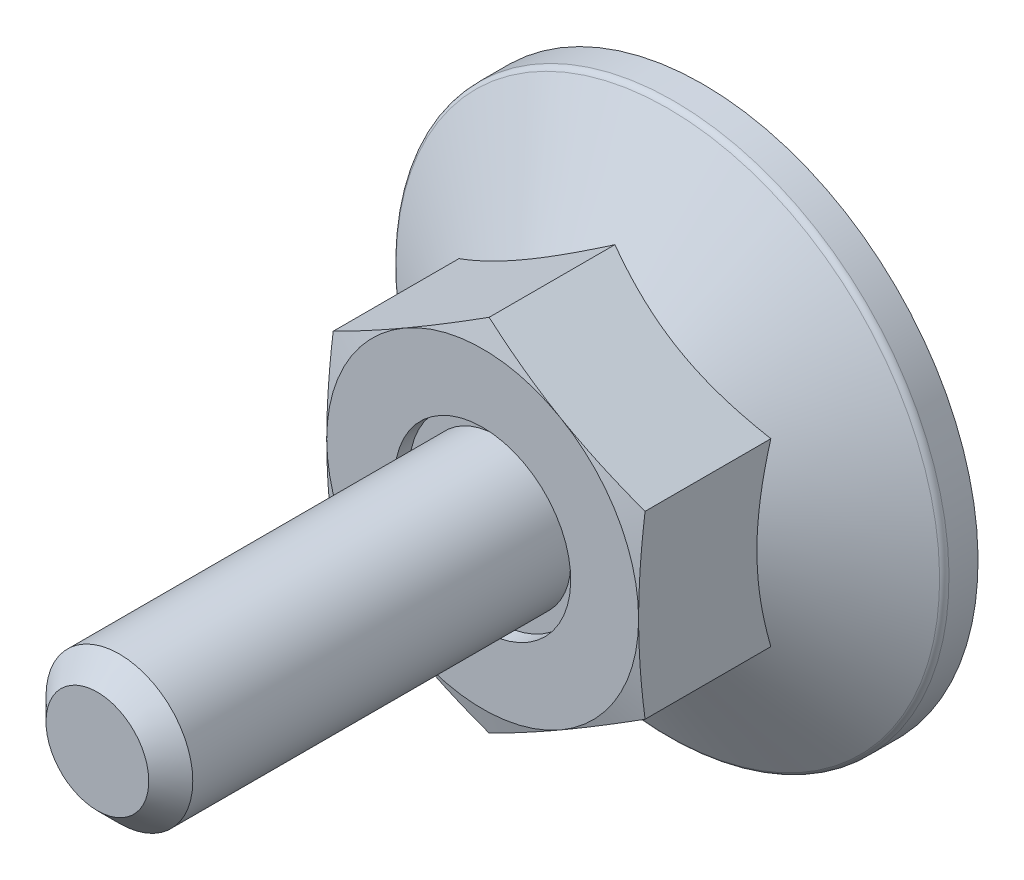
ISO-10303-21;
HEADER;
FILE_DESCRIPTION(('STEP AP214'),'2;1');
FILE_NAME('part.step','',(''),(''),'','','');
FILE_SCHEMA(('AUTOMOTIVE_DESIGN { 1 0 10303 214 1 1 1 1 }'));
ENDSEC;
DATA;
#1=APPLICATION_CONTEXT('core data for automotive mechanical design processes');
#2=APPLICATION_PROTOCOL_DEFINITION('international standard','automotive_design',2000,#1);
#3=PRODUCT_CONTEXT('',#1,'mechanical');
#4=PRODUCT('Part','Part','',(#3));
#5=PRODUCT_RELATED_PRODUCT_CATEGORY('part','',(#4));
#6=PRODUCT_DEFINITION_FORMATION('','',#4);
#7=PRODUCT_DEFINITION_CONTEXT('part definition',#1,'design');
#8=PRODUCT_DEFINITION('design','',#6,#7);
#9=PRODUCT_DEFINITION_SHAPE('','',#8);
#10=(LENGTH_UNIT() NAMED_UNIT(*) SI_UNIT(.MILLI.,.METRE.));
#11=(NAMED_UNIT(*) PLANE_ANGLE_UNIT() SI_UNIT($,.RADIAN.));
#12=(NAMED_UNIT(*) SI_UNIT($,.STERADIAN.) SOLID_ANGLE_UNIT());
#13=UNCERTAINTY_MEASURE_WITH_UNIT(LENGTH_MEASURE(1.E-05),#10,'distance_accuracy_value','');
#14=(GEOMETRIC_REPRESENTATION_CONTEXT(3) GLOBAL_UNCERTAINTY_ASSIGNED_CONTEXT((#13)) GLOBAL_UNIT_ASSIGNED_CONTEXT((#10,
#11,#12)) REPRESENTATION_CONTEXT('',''));
#15=CARTESIAN_POINT('',(0.,0.,0.));
#16=DIRECTION('',(0.,0.,1.));
#17=DIRECTION('',(1.,0.,0.));
#18=AXIS2_PLACEMENT_3D('',#15,#16,#17);
#19=CARTESIAN_POINT('',(0.,0.,11.2));
#20=DIRECTION('',(0.,0.,-1.));
#21=DIRECTION('',(0.,1.,0.));
#22=AXIS2_PLACEMENT_3D('',#19,#20,#21);
#23=PLANE('',#22);
#24=CARTESIAN_POINT('',(0.,0.,11.2));
#25=DIRECTION('',(0.,0.,-1.));
#26=DIRECTION('',(0.,1.,0.));
#27=AXIS2_PLACEMENT_3D('',#24,#25,#26);
#28=CIRCLE('',#27,4.8);
#29=CARTESIAN_POINT('',(0.,4.8,11.2));
#30=VERTEX_POINT('',#29);
#31=EDGE_CURVE('E108',#30,#30,#28,.T.);
#32=ORIENTED_EDGE('',*,*,#31,.F.);
#33=EDGE_LOOP('',(#32));
#34=FACE_BOUND('',#33,.T.);
#35=CARTESIAN_POINT('',(0.,0.,11.2));
#36=DIRECTION('',(0.,0.,-1.));
#37=DIRECTION('',(0.,1.,0.));
#38=AXIS2_PLACEMENT_3D('',#35,#36,#37);
#39=CIRCLE('',#38,4.);
#40=CARTESIAN_POINT('',(0.,4.,11.2));
#41=VERTEX_POINT('',#40);
#42=EDGE_CURVE('E259',#41,#41,#39,.F.);
#43=ORIENTED_EDGE('',*,*,#42,.F.);
#44=EDGE_LOOP('',(#43));
#45=FACE_BOUND('',#44,.T.);
#46=ADVANCED_FACE('F14',(#34,#45),#23,.F.);
#47=CARTESIAN_POINT('',(0.,9.81495457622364,32.));
#48=DIRECTION('',(0.5,-0.866025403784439,0.));
#49=DIRECTION('',(0.866025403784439,0.5,0.));
#50=AXIS2_PLACEMENT_3D('',#47,#48,#49);
#51=PLANE('',#50);
#52=CARTESIAN_POINT('',(-8.5002,4.90736181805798,4.7935207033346));
#53=CARTESIAN_POINT('',(-8.31336077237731,5.01523349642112,4.85579061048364));
#54=CARTESIAN_POINT('',(-8.1258249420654,5.1235073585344,4.91523445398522));
#55=CARTESIAN_POINT('',(-7.74923024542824,5.34093440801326,5.02769163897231));
#56=CARTESIAN_POINT('',(-7.56017075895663,5.45008795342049,5.08070220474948));
#57=CARTESIAN_POINT('',(-6.9899652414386,5.77929626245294,5.22904336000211));
#58=CARTESIAN_POINT('',(-6.60656835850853,6.00065055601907,5.31341782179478));
#59=CARTESIAN_POINT('',(-6.03282233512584,6.33190297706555,5.41235673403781));
#60=CARTESIAN_POINT('',(-5.84418723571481,6.44081150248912,5.44054155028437));
#61=CARTESIAN_POINT('',(-5.46606397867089,6.65912106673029,5.48780266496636));
#62=CARTESIAN_POINT('',(-5.27657589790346,6.76852206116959,5.5068797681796));
#63=CARTESIAN_POINT('',(-4.8972734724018,6.98751241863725,5.53544197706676));
#64=CARTESIAN_POINT('',(-4.70745974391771,7.09710142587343,5.54493796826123));
#65=CARTESIAN_POINT('',(-4.32765694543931,7.3163806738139,5.55413437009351));
#66=CARTESIAN_POINT('',(-4.13766788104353,7.42607091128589,5.55383508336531));
#67=CARTESIAN_POINT('',(-3.78247698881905,7.63114046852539,5.54412227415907));
#68=CARTESIAN_POINT('',(-3.6172500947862,7.72653426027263,5.53589358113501));
#69=CARTESIAN_POINT('',(-3.28718328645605,7.9170984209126,5.51218750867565));
#70=CARTESIAN_POINT('',(-3.12234339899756,8.01226877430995,5.49670964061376));
#71=CARTESIAN_POINT('',(-2.62846189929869,8.29741139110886,5.43976812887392));
#72=CARTESIAN_POINT('',(-2.30029449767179,8.48687892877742,5.38780368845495));
#73=CARTESIAN_POINT('',(-1.64047857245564,8.86782383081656,5.25789180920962));
#74=CARTESIAN_POINT('',(-1.30891425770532,9.05925257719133,5.17939367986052));
#75=CARTESIAN_POINT('',(-0.650730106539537,9.43925537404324,5.00123540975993));
#76=CARTESIAN_POINT('',(-0.32410184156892,9.62783429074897,4.90161711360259));
#77=CARTESIAN_POINT('',(0.000200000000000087,9.81507004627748,4.7935207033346));
#78=B_SPLINE_CURVE_WITH_KNOTS('',3,(#52,#53,#54,#55,#56,#57,#58,#59,#60,#61,#62,#63,#64,#65,#66,
#67,#68,#69,#70,#71,#72,#73,#74,#75,#76,#77),.UNSPECIFIED.,.F.,.F.,(4,2,2,2,2,2,2,2,2,2,2,2,4),
(0.,0.673596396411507,1.34748239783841,2.69805431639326,3.356799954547,4.01548737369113,
4.67342558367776,5.33134346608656,5.90409556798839,6.47688628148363,7.62328361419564,
8.79510569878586,9.9646274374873),.UNSPECIFIED.);
#79=CARTESIAN_POINT('',(-8.5,4.90747728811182,4.79358737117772));
#80=VERTEX_POINT('',#79);
#81=CARTESIAN_POINT('',(0.,9.81495457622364,4.79358737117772));
#82=VERTEX_POINT('',#81);
#83=EDGE_CURVE('E97',#80,#82,#78,.T.);
#84=ORIENTED_EDGE('',*,*,#83,.F.);
#85=DIRECTION('',(0.,0.,-1.));
#86=VECTOR('',#85,1.);
#87=CARTESIAN_POINT('',(-8.5,4.90747728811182,32.));
#88=LINE('',#87,#86);
#89=CARTESIAN_POINT('',(-8.5,4.90747728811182,11.6476589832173));
#90=VERTEX_POINT('',#89);
#91=EDGE_CURVE('E86',#90,#80,#88,.T.);
#92=ORIENTED_EDGE('',*,*,#91,.F.);
#93=CARTESIAN_POINT('',(0.000200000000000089,9.81507004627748,11.6476280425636));
#94=CARTESIAN_POINT('',(-0.352800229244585,9.61126526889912,11.7022599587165));
#95=CARTESIAN_POINT('',(-0.706440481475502,9.40709097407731,11.7518566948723));
#96=CARTESIAN_POINT('',(-1.41496987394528,8.99802133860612,11.8389934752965));
#97=CARTESIAN_POINT('',(-1.76985946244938,8.79312573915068,11.8765286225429));
#98=CARTESIAN_POINT('',(-2.47873586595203,8.38385575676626,11.9373509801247));
#99=CARTESIAN_POINT('',(-2.83271788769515,8.17948414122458,11.9607107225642));
#100=CARTESIAN_POINT('',(-3.5411333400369,7.77048028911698,11.9920337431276));
#101=CARTESIAN_POINT('',(-3.89556667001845,7.56584811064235,12.));
#102=CARTESIAN_POINT('',(-4.60443332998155,7.15658375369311,12.));
#103=CARTESIAN_POINT('',(-4.9588666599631,6.95195157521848,11.9920337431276));
#104=CARTESIAN_POINT('',(-5.66728211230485,6.54294772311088,11.9607107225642));
#105=CARTESIAN_POINT('',(-6.02126413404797,6.33857610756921,11.9373509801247));
#106=CARTESIAN_POINT('',(-6.73014053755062,5.92930612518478,11.8765286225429));
#107=CARTESIAN_POINT('',(-7.08503012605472,5.72441052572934,11.8389934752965));
#108=CARTESIAN_POINT('',(-7.7935595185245,5.31534089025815,11.7518566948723));
#109=CARTESIAN_POINT('',(-8.14719977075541,5.11116659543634,11.7022599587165));
#110=CARTESIAN_POINT('',(-8.5002,4.90736181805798,11.6476280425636));
#111=B_SPLINE_CURVE_WITH_KNOTS('',3,(#93,#94,#95,#96,#97,#98,#99,#100,#101,#102,#103,#104,#105,
#106,#107,#108,#109,#110),.UNSPECIFIED.,.F.,.F.,(4,2,2,2,2,2,2,2,4),(0.,1.23382789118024,
2.46815608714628,3.69611406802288,4.92383440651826,6.15155474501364,7.37951272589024,
8.61384092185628,9.84766881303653),.UNSPECIFIED.);
#112=CARTESIAN_POINT('',(-4.25,7.36121593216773,12.));
#113=VERTEX_POINT('',#112);
#114=EDGE_CURVE('E186',#113,#90,#111,.T.);
#115=ORIENTED_EDGE('',*,*,#114,.F.);
#116=CARTESIAN_POINT('',(0.,9.81495457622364,11.6476589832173));
#117=VERTEX_POINT('',#116);
#118=EDGE_CURVE('E318',#117,#113,#111,.T.);
#119=ORIENTED_EDGE('',*,*,#118,.F.);
#120=DIRECTION('',(0.,0.,-1.));
#121=VECTOR('',#120,1.);
#122=CARTESIAN_POINT('',(0.,9.81495457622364,32.));
#123=LINE('',#122,#121);
#124=EDGE_CURVE('E101',#117,#82,#123,.T.);
#125=ORIENTED_EDGE('',*,*,#124,.T.);
#126=EDGE_LOOP('',(#84,#92,#115,#119,#125));
#127=FACE_BOUND('',#126,.T.);
#128=ADVANCED_FACE('F100',(#127),#51,.F.);
#129=CARTESIAN_POINT('',(8.5,4.90747728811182,32.));
#130=DIRECTION('',(-0.5,-0.866025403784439,0.));
#131=DIRECTION('',(0.866025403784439,-0.5,0.));
#132=AXIS2_PLACEMENT_3D('',#129,#130,#131);
#133=PLANE('',#132);
#134=CARTESIAN_POINT('',(-0.0002,9.81507004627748,4.7935207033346));
#135=CARTESIAN_POINT('',(0.186639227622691,9.70719836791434,4.85579061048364));
#136=CARTESIAN_POINT('',(0.374175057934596,9.59892450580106,4.91523445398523));
#137=CARTESIAN_POINT('',(0.750769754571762,9.3814974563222,5.02769163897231));
#138=CARTESIAN_POINT('',(0.939829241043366,9.27234391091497,5.08070220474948));
#139=CARTESIAN_POINT('',(1.5100347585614,8.94313560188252,5.22904336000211));
#140=CARTESIAN_POINT('',(1.89343164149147,8.72178130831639,5.31341782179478));
#141=CARTESIAN_POINT('',(2.46717766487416,8.39052888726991,5.41235673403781));
#142=CARTESIAN_POINT('',(2.65581276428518,8.28162036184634,5.44054155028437));
#143=CARTESIAN_POINT('',(3.03393602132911,8.06331079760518,5.48780266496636));
#144=CARTESIAN_POINT('',(3.22342410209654,7.95390980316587,5.5068797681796));
#145=CARTESIAN_POINT('',(3.6027265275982,7.73491944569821,5.53544197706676));
#146=CARTESIAN_POINT('',(3.79254025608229,7.62533043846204,5.54493796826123));
#147=CARTESIAN_POINT('',(4.17234305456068,7.40605119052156,5.55413437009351));
#148=CARTESIAN_POINT('',(4.36233211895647,7.29636095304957,5.55383508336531));
#149=CARTESIAN_POINT('',(4.71752301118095,7.09129139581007,5.54412227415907));
#150=CARTESIAN_POINT('',(4.8827499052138,6.99589760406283,5.53589358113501));
#151=CARTESIAN_POINT('',(5.21281671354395,6.80533344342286,5.51218750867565));
#152=CARTESIAN_POINT('',(5.37765660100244,6.71016309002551,5.49670964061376));
#153=CARTESIAN_POINT('',(5.87153810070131,6.42502047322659,5.43976812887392));
#154=CARTESIAN_POINT('',(6.19970550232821,6.23555293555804,5.38780368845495));
#155=CARTESIAN_POINT('',(6.85952142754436,5.8546080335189,5.25789180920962));
#156=CARTESIAN_POINT('',(7.19108574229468,5.66317928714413,5.17939367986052));
#157=CARTESIAN_POINT('',(7.84926989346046,5.28317649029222,5.00123540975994));
#158=CARTESIAN_POINT('',(8.17589815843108,5.09459757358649,4.90161711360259));
#159=CARTESIAN_POINT('',(8.5002,4.90736181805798,4.7935207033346));
#160=B_SPLINE_CURVE_WITH_KNOTS('',3,(#134,#135,#136,#137,#138,#139,#140,#141,#142,#143,#144,
#145,#146,#147,#148,#149,#150,#151,#152,#153,#154,#155,#156,#157,#158,#159),.UNSPECIFIED.,.F.,
.F.,(4,2,2,2,2,2,2,2,2,2,2,2,4),(0.,0.673596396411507,1.34748239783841,2.69805431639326,
3.356799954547,4.01548737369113,4.67342558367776,5.33134346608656,5.90409556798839,
6.47688628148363,7.62328361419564,8.79510569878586,9.9646274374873),.UNSPECIFIED.);
#161=CARTESIAN_POINT('',(8.5,4.90747728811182,4.79358737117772));
#162=VERTEX_POINT('',#161);
#163=EDGE_CURVE('E29',#82,#162,#160,.T.);
#164=ORIENTED_EDGE('',*,*,#163,.F.);
#165=ORIENTED_EDGE('',*,*,#124,.F.);
#166=CARTESIAN_POINT('',(8.5002,4.90736181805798,11.6476280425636));
#167=CARTESIAN_POINT('',(8.14719977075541,5.11116659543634,11.7022599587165));
#168=CARTESIAN_POINT('',(7.7935595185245,5.31534089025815,11.7518566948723));
#169=CARTESIAN_POINT('',(7.08503012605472,5.72441052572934,11.8389934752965));
#170=CARTESIAN_POINT('',(6.73014053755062,5.92930612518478,11.8765286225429));
#171=CARTESIAN_POINT('',(6.02126413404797,6.33857610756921,11.9373509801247));
#172=CARTESIAN_POINT('',(5.66728211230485,6.54294772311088,11.9607107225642));
#173=CARTESIAN_POINT('',(4.9588666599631,6.95195157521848,11.9920337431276));
#174=CARTESIAN_POINT('',(4.60443332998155,7.15658375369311,12.));
#175=CARTESIAN_POINT('',(3.89556667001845,7.56584811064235,12.));
#176=CARTESIAN_POINT('',(3.5411333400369,7.77048028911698,11.9920337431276));
#177=CARTESIAN_POINT('',(2.83271788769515,8.17948414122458,11.9607107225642));
#178=CARTESIAN_POINT('',(2.47873586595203,8.38385575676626,11.9373509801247));
#179=CARTESIAN_POINT('',(1.76985946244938,8.79312573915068,11.8765286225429));
#180=CARTESIAN_POINT('',(1.41496987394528,8.99802133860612,11.8389934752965));
#181=CARTESIAN_POINT('',(0.706440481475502,9.40709097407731,11.7518566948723));
#182=CARTESIAN_POINT('',(0.352800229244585,9.61126526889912,11.7022599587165));
#183=CARTESIAN_POINT('',(-0.000200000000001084,9.81507004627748,11.6476280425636));
#184=B_SPLINE_CURVE_WITH_KNOTS('',3,(#166,#167,#168,#169,#170,#171,#172,#173,#174,#175,#176,
#177,#178,#179,#180,#181,#182,#183),.UNSPECIFIED.,.F.,.F.,(4,2,2,2,2,2,2,2,4),(0.,
1.23382789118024,2.46815608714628,3.69611406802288,4.92383440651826,6.15155474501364,
7.37951272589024,8.61384092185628,9.84766881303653),.UNSPECIFIED.);
#185=CARTESIAN_POINT('',(4.25,7.36121593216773,12.));
#186=VERTEX_POINT('',#185);
#187=EDGE_CURVE('E177',#186,#117,#184,.T.);
#188=ORIENTED_EDGE('',*,*,#187,.F.);
#189=CARTESIAN_POINT('',(8.5,4.90747728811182,11.6476589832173));
#190=VERTEX_POINT('',#189);
#191=EDGE_CURVE('E184',#190,#186,#184,.T.);
#192=ORIENTED_EDGE('',*,*,#191,.F.);
#193=DIRECTION('',(0.,0.,-1.));
#194=VECTOR('',#193,1.);
#195=CARTESIAN_POINT('',(8.5,4.90747728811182,32.));
#196=LINE('',#195,#194);
#197=EDGE_CURVE('E216',#190,#162,#196,.T.);
#198=ORIENTED_EDGE('',*,*,#197,.T.);
#199=EDGE_LOOP('',(#164,#165,#188,#192,#198));
#200=FACE_BOUND('',#199,.T.);
#201=ADVANCED_FACE('F192',(#200),#133,.F.);
#202=CARTESIAN_POINT('',(8.5,-4.90747728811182,32.));
#203=DIRECTION('',(-1.,0.,0.));
#204=DIRECTION('',(0.,-1.,0.));
#205=AXIS2_PLACEMENT_3D('',#202,#203,#204);
#206=PLANE('',#205);
#207=CARTESIAN_POINT('',(8.5,13.0314294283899,1.47752704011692));
#208=CARTESIAN_POINT('',(8.5,12.6612665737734,1.65647774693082));
#209=CARTESIAN_POINT('',(8.5,12.290237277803,1.83366776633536));
#210=CARTESIAN_POINT('',(8.5,11.5459841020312,2.1835324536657));
#211=CARTESIAN_POINT('',(8.5,11.1727598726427,2.3562063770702));
#212=CARTESIAN_POINT('',(8.5,10.4216603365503,2.69694543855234));
#213=CARTESIAN_POINT('',(8.5,10.0437706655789,2.86497902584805));
#214=CARTESIAN_POINT('',(8.5,9.2849306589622,3.19396010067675));
#215=CARTESIAN_POINT('',(8.5,8.90398047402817,3.35490793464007));
#216=CARTESIAN_POINT('',(8.5,8.12702308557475,3.67249615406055));
#217=CARTESIAN_POINT('',(8.5,7.73090483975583,3.82886642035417));
#218=CARTESIAN_POINT('',(8.5,6.93398073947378,4.12940330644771));
#219=CARTESIAN_POINT('',(8.5,6.53317435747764,4.27356853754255));
#220=CARTESIAN_POINT('',(8.5,5.72703031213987,4.54580160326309));
#221=CARTESIAN_POINT('',(8.5,5.32170421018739,4.67390329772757));
#222=CARTESIAN_POINT('',(8.5,4.50525785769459,4.90980359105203));
#223=CARTESIAN_POINT('',(8.5,4.09413952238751,5.01760873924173));
#224=CARTESIAN_POINT('',(8.5,3.26789885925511,5.20711197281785));
#225=CARTESIAN_POINT('',(8.5,2.85280627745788,5.28893618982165));
#226=CARTESIAN_POINT('',(8.5,2.22651264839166,5.38853539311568));
#227=CARTESIAN_POINT('',(8.5,2.01712321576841,5.41788026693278));
#228=CARTESIAN_POINT('',(8.5,1.59735566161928,5.46827917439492));
#229=CARTESIAN_POINT('',(8.5,1.38697763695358,5.48933400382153));
#230=CARTESIAN_POINT('',(8.5,0.968196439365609,5.52247691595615));
#231=CARTESIAN_POINT('',(8.5,0.759802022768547,5.53467524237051));
#232=CARTESIAN_POINT('',(8.5,0.342684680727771,5.55026003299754));
#233=CARTESIAN_POINT('',(8.5,0.133961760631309,5.5536466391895));
#234=CARTESIAN_POINT('',(8.5,-0.283445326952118,5.55152742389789));
#235=CARTESIAN_POINT('',(8.5,-0.492129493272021,5.546021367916));
#236=CARTESIAN_POINT('',(8.5,-0.909085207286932,5.52624824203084));
#237=CARTESIAN_POINT('',(8.5,-1.11735673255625,5.51198070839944));
#238=CARTESIAN_POINT('',(8.5,-1.62231800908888,5.46706351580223));
#239=CARTESIAN_POINT('',(8.5,-1.91862399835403,5.43201243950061));
#240=CARTESIAN_POINT('',(8.5,-2.50892471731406,5.34612267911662));
#241=CARTESIAN_POINT('',(8.5,-2.80291910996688,5.29528173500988));
#242=CARTESIAN_POINT('',(8.5,-3.68114216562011,5.12178025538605));
#243=CARTESIAN_POINT('',(8.5,-4.26128126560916,4.97817413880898));
#244=CARTESIAN_POINT('',(8.5,-5.12903133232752,4.73045572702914));
#245=CARTESIAN_POINT('',(8.5,-5.42116721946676,4.64129591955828));
#246=CARTESIAN_POINT('',(8.5,-6.0025970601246,4.45406394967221));
#247=CARTESIAN_POINT('',(8.5,-6.29189099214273,4.35599171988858));
#248=CARTESIAN_POINT('',(8.5,-6.86774141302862,4.15248019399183));
#249=CARTESIAN_POINT('',(8.5,-7.15429879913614,4.0470434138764));
#250=CARTESIAN_POINT('',(8.5,-7.72505625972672,3.83000899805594));
#251=CARTESIAN_POINT('',(8.5,-8.00925638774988,3.71841150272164));
#252=CARTESIAN_POINT('',(8.5,-8.7865968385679,3.40502511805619));
#253=CARTESIAN_POINT('',(8.5,-9.2776226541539,3.197996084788));
#254=CARTESIAN_POINT('',(8.5,-10.2546964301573,2.77246752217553));
#255=CARTESIAN_POINT('',(8.5,-10.7407438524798,2.55396676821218));
#256=CARTESIAN_POINT('',(8.5,-11.7090438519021,2.108282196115));
#257=CARTESIAN_POINT('',(8.5,-12.1912949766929,1.88109523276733));
#258=CARTESIAN_POINT('',(8.5,-13.1526185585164,1.42016244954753));
#259=CARTESIAN_POINT('',(8.5,-13.6316911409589,1.18641689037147));
#260=CARTESIAN_POINT('',(8.5,-14.588034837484,0.713462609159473));
#261=CARTESIAN_POINT('',(8.5,-15.0653020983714,0.47424611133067));
#262=CARTESIAN_POINT('',(8.5,-16.0177905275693,-0.00822936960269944));
#263=CARTESIAN_POINT('',(8.5,-16.4930116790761,-0.251488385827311));
#264=CARTESIAN_POINT('',(8.5,-17.4416812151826,-0.741191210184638));
#265=CARTESIAN_POINT('',(8.5,-17.9151299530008,-0.987634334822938));
#266=CARTESIAN_POINT('',(8.5,-18.8606492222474,-1.48315179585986));
#267=CARTESIAN_POINT('',(8.5,-19.3327197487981,-1.73222614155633));
#268=CARTESIAN_POINT('',(8.5,-20.6461392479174,-2.42904815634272));
#269=CARTESIAN_POINT('',(8.5,-21.4862394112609,-2.87914918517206));
#270=CARTESIAN_POINT('',(8.5,-23.1638169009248,-3.78432075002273));
#271=CARTESIAN_POINT('',(8.5,-24.0012940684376,-4.23939157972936));
#272=CARTESIAN_POINT('',(8.5,-25.671623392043,-5.15180725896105));
#273=CARTESIAN_POINT('',(8.5,-26.5044818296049,-5.60914061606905));
#274=CARTESIAN_POINT('',(8.5,-27.7525740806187,-6.29723391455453));
#275=CARTESIAN_POINT('',(8.5,-28.1683903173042,-6.52693873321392));
#276=CARTESIAN_POINT('',(8.5,-28.9996764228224,-6.98697325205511));
#277=CARTESIAN_POINT('',(8.5,-29.4151462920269,-7.21730295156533));
#278=CARTESIAN_POINT('',(8.5,-29.8304643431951,-7.44790614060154));
#279=B_SPLINE_CURVE_WITH_KNOTS('',3,(#207,#208,#209,#210,#211,#212,#213,#214,#215,#216,#217,
#218,#219,#220,#221,#222,#223,#224,#225,#226,#227,#228,#229,#230,#231,#232,#233,#234,#235,#236,
#237,#238,#239,#240,#241,#242,#243,#244,#245,#246,#247,#248,#249,#250,#251,#252,#253,#254,#255,
#256,#257,#258,#259,#260,#261,#262,#263,#264,#265,#266,#267,#268,#269,#270,#271,#272,#273,#274,
#275,#276,#277,#278),.UNSPECIFIED.,.F.,.F.,(4,2,2,2,2,2,2,2,2,2,2,2,2,2,2,2,2,2,2,2,2,2,2,2,2,2,
2,2,2,2,2,2,2,2,2,4),(0.,1.23346428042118,2.46713064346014,3.70776702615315,4.94834268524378,
6.22578289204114,7.5033682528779,8.77821366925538,10.0526470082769,11.32079515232,
11.9549638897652,12.5890717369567,13.2151443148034,13.8412068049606,14.4672858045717,
15.0933979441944,15.9880059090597,16.8827419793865,18.6732029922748,19.5894472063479,
20.5056983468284,21.4216379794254,22.3375567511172,23.9359919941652,25.5345982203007,
27.1337888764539,28.7329160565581,30.3344778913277,31.9360528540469,33.5372895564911,
35.1385319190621,37.9977422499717,40.8571224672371,43.7075995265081,45.1327331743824,
46.5578652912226),.UNSPECIFIED.);
#280=CARTESIAN_POINT('',(8.5,-4.90747728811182,4.79358737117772));
#281=VERTEX_POINT('',#280);
#282=EDGE_CURVE('E37',#162,#281,#279,.T.);
#283=ORIENTED_EDGE('',*,*,#282,.F.);
#284=ORIENTED_EDGE('',*,*,#197,.F.);
#285=CARTESIAN_POINT('',(8.5,12.9820891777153,10.1197370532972));
#286=CARTESIAN_POINT('',(8.5,12.5964686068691,10.2061594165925));
#287=CARTESIAN_POINT('',(8.5,12.2106068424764,10.2915248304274));
#288=CARTESIAN_POINT('',(8.5,11.4382824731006,10.4595712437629));
#289=CARTESIAN_POINT('',(8.5,11.0518198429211,10.5422521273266));
#290=CARTESIAN_POINT('',(8.5,10.2778290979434,10.7044309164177));
#291=CARTESIAN_POINT('',(8.5,9.89030030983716,10.7839256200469));
#292=CARTESIAN_POINT('',(8.5,9.11443612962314,10.9388739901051));
#293=CARTESIAN_POINT('',(8.5,8.72610074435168,11.0143276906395));
#294=CARTESIAN_POINT('',(8.5,7.95158013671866,11.159650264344));
#295=CARTESIAN_POINT('',(8.5,7.56540239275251,11.2295587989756));
#296=CARTESIAN_POINT('',(8.5,6.79199352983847,11.3632725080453));
#297=CARTESIAN_POINT('',(8.5,6.40476243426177,11.4270778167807));
#298=CARTESIAN_POINT('',(8.5,5.62917169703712,11.54714843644));
#299=CARTESIAN_POINT('',(8.5,5.24081220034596,11.6034146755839));
#300=CARTESIAN_POINT('',(8.5,4.46285737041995,11.70674908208));
#301=CARTESIAN_POINT('',(8.5,4.07326203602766,11.7538172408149));
#302=CARTESIAN_POINT('',(8.5,3.28844017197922,11.8374226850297));
#303=CARTESIAN_POINT('',(8.5,2.89320002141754,11.8738340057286));
#304=CARTESIAN_POINT('',(8.5,2.10172608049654,11.9336139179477));
#305=CARTESIAN_POINT('',(8.5,1.70549231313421,11.9569828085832));
#306=CARTESIAN_POINT('',(8.5,0.91260591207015,11.9893148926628));
#307=CARTESIAN_POINT('',(8.5,0.515953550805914,11.9982846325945));
#308=CARTESIAN_POINT('',(8.5,-0.277408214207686,12.0012669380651));
#309=CARTESIAN_POINT('',(8.5,-0.674117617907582,11.9952795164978));
#310=CARTESIAN_POINT('',(8.5,-1.46847963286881,11.9686842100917));
#311=CARTESIAN_POINT('',(8.5,-1.86613043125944,11.9480232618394));
#312=CARTESIAN_POINT('',(8.5,-2.66049684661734,11.8932602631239));
#313=CARTESIAN_POINT('',(8.5,-3.05721244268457,11.8591579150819));
#314=CARTESIAN_POINT('',(8.5,-3.84970511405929,11.7792347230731));
#315=CARTESIAN_POINT('',(8.5,-4.24548140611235,11.7334062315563));
#316=CARTESIAN_POINT('',(8.5,-5.03576028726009,11.6319377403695));
#317=CARTESIAN_POINT('',(8.5,-5.43026287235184,11.5762977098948));
#318=CARTESIAN_POINT('',(8.5,-6.19195385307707,11.4609360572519));
#319=CARTESIAN_POINT('',(8.5,-6.55922094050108,11.4017287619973));
#320=CARTESIAN_POINT('',(8.5,-7.29278719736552,11.2775674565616));
#321=CARTESIAN_POINT('',(8.5,-7.65908634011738,11.2126132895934));
#322=CARTESIAN_POINT('',(8.5,-8.39085027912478,11.078008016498));
#323=CARTESIAN_POINT('',(8.5,-8.75631499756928,11.0083564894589));
#324=CARTESIAN_POINT('',(8.5,-9.48649515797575,10.8652200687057));
#325=CARTESIAN_POINT('',(8.5,-9.85121059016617,10.7917351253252));
#326=CARTESIAN_POINT('',(8.5,-10.5800753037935,10.6416087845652));
#327=CARTESIAN_POINT('',(8.5,-10.944224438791,10.5649666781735));
#328=CARTESIAN_POINT('',(8.5,-11.6719684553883,10.4090909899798));
#329=CARTESIAN_POINT('',(8.5,-12.0355633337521,10.3298573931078));
#330=CARTESIAN_POINT('',(8.5,-13.1255915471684,10.0889686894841));
#331=CARTESIAN_POINT('',(8.5,-13.8513178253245,9.92411536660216));
#332=CARTESIAN_POINT('',(8.5,-15.2942598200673,9.59010912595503));
#333=CARTESIAN_POINT('',(8.5,-16.0114890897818,9.42101437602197));
#334=CARTESIAN_POINT('',(8.5,-17.4449475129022,9.07858755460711));
#335=CARTESIAN_POINT('',(8.5,-18.1611766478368,8.90525540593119));
#336=CARTESIAN_POINT('',(8.5,-19.5919856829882,8.5556799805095));
#337=CARTESIAN_POINT('',(8.5,-20.306566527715,8.37944056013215));
#338=CARTESIAN_POINT('',(8.5,-21.7351057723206,8.02455520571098));
#339=CARTESIAN_POINT('',(8.5,-22.4490641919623,7.8459093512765));
#340=CARTESIAN_POINT('',(8.5,-23.1628057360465,7.66641079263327));
#341=B_SPLINE_CURVE_WITH_KNOTS('',3,(#285,#286,#287,#288,#289,#290,#291,#292,#293,#294,#295,
#296,#297,#298,#299,#300,#301,#302,#303,#304,#305,#306,#307,#308,#309,#310,#311,#312,#313,#314,
#315,#316,#317,#318,#319,#320,#321,#322,#323,#324,#325,#326,#327,#328,#329,#330,#331,#332,#333,
#334,#335,#336,#337,#338,#339,#340),.UNSPECIFIED.,.F.,.F.,(4,2,2,2,2,2,2,2,2,2,2,2,2,2,2,2,2,2,
2,2,2,2,2,2,2,2,2,4),(0.,1.18556310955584,2.37117735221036,3.55795462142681,4.74472187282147,
5.92204594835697,7.09934411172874,8.27649719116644,9.45365137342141,10.6442044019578,
11.8347301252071,13.0247144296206,14.2146977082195,15.4090063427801,16.6033414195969,
17.7984574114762,18.9935771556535,20.1095500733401,21.2255534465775,22.3416569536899,
23.4577749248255,24.5741449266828,25.6905214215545,27.9231231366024,30.1337863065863,
32.3444897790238,34.5524651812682,36.7603677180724),.UNSPECIFIED.);
#342=CARTESIAN_POINT('',(8.5,0.,12.));
#343=VERTEX_POINT('',#342);
#344=EDGE_CURVE('E170',#343,#190,#341,.F.);
#345=ORIENTED_EDGE('',*,*,#344,.F.);
#346=CARTESIAN_POINT('',(8.5,-4.90747728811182,11.6476589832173));
#347=VERTEX_POINT('',#346);
#348=EDGE_CURVE('E185',#347,#343,#341,.F.);
#349=ORIENTED_EDGE('',*,*,#348,.F.);
#350=DIRECTION('',(0.,0.,-1.));
#351=VECTOR('',#350,1.);
#352=CARTESIAN_POINT('',(8.5,-4.90747728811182,32.));
#353=LINE('',#352,#351);
#354=EDGE_CURVE('E218',#347,#281,#353,.T.);
#355=ORIENTED_EDGE('',*,*,#354,.T.);
#356=EDGE_LOOP('',(#283,#284,#345,#349,#355));
#357=FACE_BOUND('',#356,.T.);
#358=ADVANCED_FACE('F195',(#357),#206,.F.);
#359=CARTESIAN_POINT('',(0.,-9.81495457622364,32.));
#360=DIRECTION('',(-0.5,0.866025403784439,0.));
#361=DIRECTION('',(-0.866025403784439,-0.5,0.));
#362=AXIS2_PLACEMENT_3D('',#359,#360,#361);
#363=PLANE('',#362);
#364=CARTESIAN_POINT('',(8.5002,-4.90736181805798,4.7935207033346));
#365=CARTESIAN_POINT('',(8.31336077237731,-5.01523349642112,4.85579061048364));
#366=CARTESIAN_POINT('',(8.1258249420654,-5.1235073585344,4.91523445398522));
#367=CARTESIAN_POINT('',(7.74923024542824,-5.34093440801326,5.02769163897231));
#368=CARTESIAN_POINT('',(7.56017075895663,-5.45008795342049,5.08070220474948));
#369=CARTESIAN_POINT('',(6.9899652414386,-5.77929626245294,5.22904336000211));
#370=CARTESIAN_POINT('',(6.60656835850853,-6.00065055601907,5.31341782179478));
#371=CARTESIAN_POINT('',(6.03282233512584,-6.33190297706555,5.41235673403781));
#372=CARTESIAN_POINT('',(5.84418723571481,-6.44081150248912,5.44054155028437));
#373=CARTESIAN_POINT('',(5.46606397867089,-6.65912106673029,5.48780266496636));
#374=CARTESIAN_POINT('',(5.27657589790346,-6.76852206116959,5.5068797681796));
#375=CARTESIAN_POINT('',(4.8972734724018,-6.98751241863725,5.53544197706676));
#376=CARTESIAN_POINT('',(4.70745974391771,-7.09710142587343,5.54493796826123));
#377=CARTESIAN_POINT('',(4.32765694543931,-7.3163806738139,5.55413437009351));
#378=CARTESIAN_POINT('',(4.13766788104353,-7.42607091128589,5.55383508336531));
#379=CARTESIAN_POINT('',(3.78247698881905,-7.63114046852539,5.54412227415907));
#380=CARTESIAN_POINT('',(3.6172500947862,-7.72653426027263,5.53589358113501));
#381=CARTESIAN_POINT('',(3.28718328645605,-7.9170984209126,5.51218750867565));
#382=CARTESIAN_POINT('',(3.12234339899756,-8.01226877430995,5.49670964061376));
#383=CARTESIAN_POINT('',(2.62846189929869,-8.29741139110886,5.43976812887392));
#384=CARTESIAN_POINT('',(2.30029449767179,-8.48687892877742,5.38780368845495));
#385=CARTESIAN_POINT('',(1.64047857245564,-8.86782383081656,5.25789180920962));
#386=CARTESIAN_POINT('',(1.30891425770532,-9.05925257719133,5.17939367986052));
#387=CARTESIAN_POINT('',(0.650730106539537,-9.43925537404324,5.00123540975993));
#388=CARTESIAN_POINT('',(0.32410184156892,-9.62783429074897,4.90161711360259));
#389=CARTESIAN_POINT('',(-0.000200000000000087,-9.81507004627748,4.7935207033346));
#390=B_SPLINE_CURVE_WITH_KNOTS('',3,(#364,#365,#366,#367,#368,#369,#370,#371,#372,#373,#374,
#375,#376,#377,#378,#379,#380,#381,#382,#383,#384,#385,#386,#387,#388,#389),.UNSPECIFIED.,.F.,
.F.,(4,2,2,2,2,2,2,2,2,2,2,2,4),(0.,0.673596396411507,1.34748239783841,2.69805431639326,
3.356799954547,4.01548737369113,4.67342558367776,5.33134346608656,5.90409556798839,
6.47688628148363,7.62328361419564,8.79510569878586,9.9646274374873),.UNSPECIFIED.);
#391=CARTESIAN_POINT('',(0.,-9.81495457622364,4.79358737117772));
#392=VERTEX_POINT('',#391);
#393=EDGE_CURVE('E276',#281,#392,#390,.T.);
#394=ORIENTED_EDGE('',*,*,#393,.F.);
#395=ORIENTED_EDGE('',*,*,#354,.F.);
#396=CARTESIAN_POINT('',(-0.000200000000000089,-9.81507004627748,11.6476280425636));
#397=CARTESIAN_POINT('',(0.352800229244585,-9.61126526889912,11.7022599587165));
#398=CARTESIAN_POINT('',(0.706440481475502,-9.40709097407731,11.7518566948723));
#399=CARTESIAN_POINT('',(1.41496987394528,-8.99802133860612,11.8389934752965));
#400=CARTESIAN_POINT('',(1.76985946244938,-8.79312573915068,11.8765286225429));
#401=CARTESIAN_POINT('',(2.47873586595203,-8.38385575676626,11.9373509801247));
#402=CARTESIAN_POINT('',(2.83271788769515,-8.17948414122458,11.9607107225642));
#403=CARTESIAN_POINT('',(3.5411333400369,-7.77048028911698,11.9920337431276));
#404=CARTESIAN_POINT('',(3.89556667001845,-7.56584811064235,12.));
#405=CARTESIAN_POINT('',(4.60443332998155,-7.15658375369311,12.));
#406=CARTESIAN_POINT('',(4.9588666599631,-6.95195157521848,11.9920337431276));
#407=CARTESIAN_POINT('',(5.66728211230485,-6.54294772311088,11.9607107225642));
#408=CARTESIAN_POINT('',(6.02126413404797,-6.33857610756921,11.9373509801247));
#409=CARTESIAN_POINT('',(6.73014053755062,-5.92930612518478,11.8765286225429));
#410=CARTESIAN_POINT('',(7.08503012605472,-5.72441052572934,11.8389934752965));
#411=CARTESIAN_POINT('',(7.7935595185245,-5.31534089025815,11.7518566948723));
#412=CARTESIAN_POINT('',(8.14719977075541,-5.11116659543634,11.7022599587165));
#413=CARTESIAN_POINT('',(8.5002,-4.90736181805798,11.6476280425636));
#414=B_SPLINE_CURVE_WITH_KNOTS('',3,(#396,#397,#398,#399,#400,#401,#402,#403,#404,#405,#406,
#407,#408,#409,#410,#411,#412,#413),.UNSPECIFIED.,.F.,.F.,(4,2,2,2,2,2,2,2,4),(0.,
1.23382789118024,2.46815608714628,3.69611406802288,4.92383440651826,6.15155474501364,
7.37951272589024,8.61384092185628,9.84766881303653),.UNSPECIFIED.);
#415=CARTESIAN_POINT('',(4.25,-7.36121593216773,12.));
#416=VERTEX_POINT('',#415);
#417=EDGE_CURVE('E164',#416,#347,#414,.T.);
#418=ORIENTED_EDGE('',*,*,#417,.F.);
#419=CARTESIAN_POINT('',(0.,-9.81495457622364,11.6476589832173));
#420=VERTEX_POINT('',#419);
#421=EDGE_CURVE('E299',#420,#416,#414,.T.);
#422=ORIENTED_EDGE('',*,*,#421,.F.);
#423=DIRECTION('',(0.,0.,-1.));
#424=VECTOR('',#423,1.);
#425=CARTESIAN_POINT('',(0.,-9.81495457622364,32.));
#426=LINE('',#425,#424);
#427=EDGE_CURVE('E220',#420,#392,#426,.T.);
#428=ORIENTED_EDGE('',*,*,#427,.T.);
#429=EDGE_LOOP('',(#394,#395,#418,#422,#428));
#430=FACE_BOUND('',#429,.T.);
#431=ADVANCED_FACE('F281',(#430),#363,.F.);
#432=CARTESIAN_POINT('',(-8.5,-4.90747728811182,32.));
#433=DIRECTION('',(0.5,0.866025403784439,0.));
#434=DIRECTION('',(-0.866025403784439,0.5,0.));
#435=AXIS2_PLACEMENT_3D('',#432,#433,#434);
#436=PLANE('',#435);
#437=CARTESIAN_POINT('',(0.0002,-9.81507004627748,4.7935207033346));
#438=CARTESIAN_POINT('',(-0.186639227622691,-9.70719836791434,4.85579061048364));
#439=CARTESIAN_POINT('',(-0.374175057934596,-9.59892450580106,4.91523445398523));
#440=CARTESIAN_POINT('',(-0.750769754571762,-9.3814974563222,5.02769163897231));
#441=CARTESIAN_POINT('',(-0.939829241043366,-9.27234391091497,5.08070220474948));
#442=CARTESIAN_POINT('',(-1.5100347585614,-8.94313560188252,5.22904336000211));
#443=CARTESIAN_POINT('',(-1.89343164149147,-8.72178130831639,5.31341782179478));
#444=CARTESIAN_POINT('',(-2.46717766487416,-8.39052888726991,5.41235673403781));
#445=CARTESIAN_POINT('',(-2.65581276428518,-8.28162036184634,5.44054155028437));
#446=CARTESIAN_POINT('',(-3.03393602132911,-8.06331079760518,5.48780266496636));
#447=CARTESIAN_POINT('',(-3.22342410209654,-7.95390980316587,5.5068797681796));
#448=CARTESIAN_POINT('',(-3.6027265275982,-7.73491944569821,5.53544197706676));
#449=CARTESIAN_POINT('',(-3.79254025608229,-7.62533043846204,5.54493796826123));
#450=CARTESIAN_POINT('',(-4.17234305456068,-7.40605119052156,5.55413437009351));
#451=CARTESIAN_POINT('',(-4.36233211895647,-7.29636095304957,5.55383508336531));
#452=CARTESIAN_POINT('',(-4.71752301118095,-7.09129139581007,5.54412227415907));
#453=CARTESIAN_POINT('',(-4.8827499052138,-6.99589760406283,5.53589358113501));
#454=CARTESIAN_POINT('',(-5.21281671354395,-6.80533344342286,5.51218750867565));
#455=CARTESIAN_POINT('',(-5.37765660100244,-6.71016309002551,5.49670964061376));
#456=CARTESIAN_POINT('',(-5.87153810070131,-6.42502047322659,5.43976812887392));
#457=CARTESIAN_POINT('',(-6.19970550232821,-6.23555293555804,5.38780368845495));
#458=CARTESIAN_POINT('',(-6.85952142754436,-5.8546080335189,5.25789180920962));
#459=CARTESIAN_POINT('',(-7.19108574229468,-5.66317928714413,5.17939367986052));
#460=CARTESIAN_POINT('',(-7.84926989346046,-5.28317649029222,5.00123540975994));
#461=CARTESIAN_POINT('',(-8.17589815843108,-5.09459757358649,4.90161711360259));
#462=CARTESIAN_POINT('',(-8.5002,-4.90736181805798,4.7935207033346));
#463=B_SPLINE_CURVE_WITH_KNOTS('',3,(#437,#438,#439,#440,#441,#442,#443,#444,#445,#446,#447,
#448,#449,#450,#451,#452,#453,#454,#455,#456,#457,#458,#459,#460,#461,#462),.UNSPECIFIED.,.F.,
.F.,(4,2,2,2,2,2,2,2,2,2,2,2,4),(0.,0.673596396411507,1.34748239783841,2.69805431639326,
3.356799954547,4.01548737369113,4.67342558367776,5.33134346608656,5.90409556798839,
6.47688628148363,7.62328361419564,8.79510569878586,9.9646274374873),.UNSPECIFIED.);
#464=CARTESIAN_POINT('',(-8.5,-4.90747728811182,4.79358737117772));
#465=VERTEX_POINT('',#464);
#466=EDGE_CURVE('E107',#392,#465,#463,.T.);
#467=ORIENTED_EDGE('',*,*,#466,.F.);
#468=ORIENTED_EDGE('',*,*,#427,.F.);
#469=CARTESIAN_POINT('',(-8.5002,-4.90736181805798,11.6476280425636));
#470=CARTESIAN_POINT('',(-8.14719977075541,-5.11116659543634,11.7022599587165));
#471=CARTESIAN_POINT('',(-7.7935595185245,-5.31534089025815,11.7518566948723));
#472=CARTESIAN_POINT('',(-7.08503012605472,-5.72441052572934,11.8389934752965));
#473=CARTESIAN_POINT('',(-6.73014053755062,-5.92930612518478,11.8765286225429));
#474=CARTESIAN_POINT('',(-6.02126413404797,-6.33857610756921,11.9373509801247));
#475=CARTESIAN_POINT('',(-5.66728211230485,-6.54294772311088,11.9607107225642));
#476=CARTESIAN_POINT('',(-4.9588666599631,-6.95195157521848,11.9920337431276));
#477=CARTESIAN_POINT('',(-4.60443332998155,-7.15658375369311,12.));
#478=CARTESIAN_POINT('',(-3.89556667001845,-7.56584811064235,12.));
#479=CARTESIAN_POINT('',(-3.5411333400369,-7.77048028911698,11.9920337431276));
#480=CARTESIAN_POINT('',(-2.83271788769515,-8.17948414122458,11.9607107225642));
#481=CARTESIAN_POINT('',(-2.47873586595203,-8.38385575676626,11.9373509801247));
#482=CARTESIAN_POINT('',(-1.76985946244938,-8.79312573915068,11.8765286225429));
#483=CARTESIAN_POINT('',(-1.41496987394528,-8.99802133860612,11.8389934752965));
#484=CARTESIAN_POINT('',(-0.706440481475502,-9.40709097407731,11.7518566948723));
#485=CARTESIAN_POINT('',(-0.352800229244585,-9.61126526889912,11.7022599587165));
#486=CARTESIAN_POINT('',(0.000200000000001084,-9.81507004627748,11.6476280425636));
#487=B_SPLINE_CURVE_WITH_KNOTS('',3,(#469,#470,#471,#472,#473,#474,#475,#476,#477,#478,#479,
#480,#481,#482,#483,#484,#485,#486),.UNSPECIFIED.,.F.,.F.,(4,2,2,2,2,2,2,2,4),(0.,
1.23382789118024,2.46815608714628,3.69611406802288,4.92383440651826,6.15155474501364,
7.37951272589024,8.61384092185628,9.84766881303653),.UNSPECIFIED.);
#488=CARTESIAN_POINT('',(-4.25,-7.36121593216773,12.));
#489=VERTEX_POINT('',#488);
#490=EDGE_CURVE('E144',#489,#420,#487,.T.);
#491=ORIENTED_EDGE('',*,*,#490,.F.);
#492=CARTESIAN_POINT('',(-8.5,-4.90747728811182,11.6476589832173));
#493=VERTEX_POINT('',#492);
#494=EDGE_CURVE('E226',#493,#489,#487,.T.);
#495=ORIENTED_EDGE('',*,*,#494,.F.);
#496=DIRECTION('',(0.,0.,-1.));
#497=VECTOR('',#496,1.);
#498=CARTESIAN_POINT('',(-8.5,-4.90747728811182,32.));
#499=LINE('',#498,#497);
#500=EDGE_CURVE('E96',#493,#465,#499,.T.);
#501=ORIENTED_EDGE('',*,*,#500,.T.);
#502=EDGE_LOOP('',(#467,#468,#491,#495,#501));
#503=FACE_BOUND('',#502,.T.);
#504=ADVANCED_FACE('F129',(#503),#436,.F.);
#505=CARTESIAN_POINT('',(-8.5,4.90747728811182,32.));
#506=DIRECTION('',(1.,0.,0.));
#507=DIRECTION('',(0.,1.,0.));
#508=AXIS2_PLACEMENT_3D('',#505,#506,#507);
#509=PLANE('',#508);
#510=CARTESIAN_POINT('',(-8.5,13.0314294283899,1.47752704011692));
#511=CARTESIAN_POINT('',(-8.5,12.6612665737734,1.65647774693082));
#512=CARTESIAN_POINT('',(-8.5,12.290237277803,1.83366776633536));
#513=CARTESIAN_POINT('',(-8.5,11.5459841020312,2.1835324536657));
#514=CARTESIAN_POINT('',(-8.5,11.1727598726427,2.3562063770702));
#515=CARTESIAN_POINT('',(-8.5,10.4216603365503,2.69694543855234));
#516=CARTESIAN_POINT('',(-8.5,10.0437706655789,2.86497902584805));
#517=CARTESIAN_POINT('',(-8.5,9.2849306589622,3.19396010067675));
#518=CARTESIAN_POINT('',(-8.5,8.90398047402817,3.35490793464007));
#519=CARTESIAN_POINT('',(-8.5,8.12702308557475,3.67249615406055));
#520=CARTESIAN_POINT('',(-8.5,7.73090483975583,3.82886642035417));
#521=CARTESIAN_POINT('',(-8.5,6.93398073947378,4.12940330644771));
#522=CARTESIAN_POINT('',(-8.5,6.53317435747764,4.27356853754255));
#523=CARTESIAN_POINT('',(-8.5,5.72703031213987,4.54580160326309));
#524=CARTESIAN_POINT('',(-8.5,5.32170421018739,4.67390329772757));
#525=CARTESIAN_POINT('',(-8.5,4.50525785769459,4.90980359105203));
#526=CARTESIAN_POINT('',(-8.5,4.09413952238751,5.01760873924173));
#527=CARTESIAN_POINT('',(-8.5,3.26789885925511,5.20711197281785));
#528=CARTESIAN_POINT('',(-8.5,2.85280627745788,5.28893618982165));
#529=CARTESIAN_POINT('',(-8.5,2.22651264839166,5.38853539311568));
#530=CARTESIAN_POINT('',(-8.5,2.01712321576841,5.41788026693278));
#531=CARTESIAN_POINT('',(-8.5,1.59735566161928,5.46827917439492));
#532=CARTESIAN_POINT('',(-8.5,1.38697763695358,5.48933400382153));
#533=CARTESIAN_POINT('',(-8.5,0.968196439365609,5.52247691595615));
#534=CARTESIAN_POINT('',(-8.5,0.759802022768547,5.53467524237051));
#535=CARTESIAN_POINT('',(-8.5,0.342684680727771,5.55026003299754));
#536=CARTESIAN_POINT('',(-8.5,0.133961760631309,5.5536466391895));
#537=CARTESIAN_POINT('',(-8.5,-0.283445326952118,5.55152742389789));
#538=CARTESIAN_POINT('',(-8.5,-0.492129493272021,5.546021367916));
#539=CARTESIAN_POINT('',(-8.5,-0.909085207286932,5.52624824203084));
#540=CARTESIAN_POINT('',(-8.5,-1.11735673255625,5.51198070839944));
#541=CARTESIAN_POINT('',(-8.5,-1.62231800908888,5.46706351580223));
#542=CARTESIAN_POINT('',(-8.5,-1.91862399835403,5.43201243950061));
#543=CARTESIAN_POINT('',(-8.5,-2.50892471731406,5.34612267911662));
#544=CARTESIAN_POINT('',(-8.5,-2.80291910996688,5.29528173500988));
#545=CARTESIAN_POINT('',(-8.5,-3.68114216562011,5.12178025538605));
#546=CARTESIAN_POINT('',(-8.5,-4.26128126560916,4.97817413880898));
#547=CARTESIAN_POINT('',(-8.5,-5.12903133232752,4.73045572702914));
#548=CARTESIAN_POINT('',(-8.5,-5.42116721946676,4.64129591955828));
#549=CARTESIAN_POINT('',(-8.5,-6.0025970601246,4.45406394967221));
#550=CARTESIAN_POINT('',(-8.5,-6.29189099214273,4.35599171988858));
#551=CARTESIAN_POINT('',(-8.5,-6.86774141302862,4.15248019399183));
#552=CARTESIAN_POINT('',(-8.5,-7.15429879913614,4.0470434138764));
#553=CARTESIAN_POINT('',(-8.5,-7.72505625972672,3.83000899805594));
#554=CARTESIAN_POINT('',(-8.5,-8.00925638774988,3.71841150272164));
#555=CARTESIAN_POINT('',(-8.5,-8.7865968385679,3.40502511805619));
#556=CARTESIAN_POINT('',(-8.5,-9.2776226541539,3.197996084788));
#557=CARTESIAN_POINT('',(-8.5,-10.2546964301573,2.77246752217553));
#558=CARTESIAN_POINT('',(-8.5,-10.7407438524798,2.55396676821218));
#559=CARTESIAN_POINT('',(-8.5,-11.7090438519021,2.108282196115));
#560=CARTESIAN_POINT('',(-8.5,-12.1912949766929,1.88109523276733));
#561=CARTESIAN_POINT('',(-8.5,-13.1526185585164,1.42016244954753));
#562=CARTESIAN_POINT('',(-8.5,-13.6316911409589,1.18641689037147));
#563=CARTESIAN_POINT('',(-8.5,-14.588034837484,0.713462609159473));
#564=CARTESIAN_POINT('',(-8.5,-15.0653020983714,0.47424611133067));
#565=CARTESIAN_POINT('',(-8.5,-16.0177905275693,-0.00822936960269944));
#566=CARTESIAN_POINT('',(-8.5,-16.4930116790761,-0.251488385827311));
#567=CARTESIAN_POINT('',(-8.5,-17.4416812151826,-0.741191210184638));
#568=CARTESIAN_POINT('',(-8.5,-17.9151299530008,-0.987634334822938));
#569=CARTESIAN_POINT('',(-8.5,-18.8606492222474,-1.48315179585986));
#570=CARTESIAN_POINT('',(-8.5,-19.3327197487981,-1.73222614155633));
#571=CARTESIAN_POINT('',(-8.5,-20.6461392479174,-2.42904815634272));
#572=CARTESIAN_POINT('',(-8.5,-21.4862394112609,-2.87914918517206));
#573=CARTESIAN_POINT('',(-8.5,-23.1638169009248,-3.78432075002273));
#574=CARTESIAN_POINT('',(-8.5,-24.0012940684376,-4.23939157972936));
#575=CARTESIAN_POINT('',(-8.5,-25.671623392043,-5.15180725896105));
#576=CARTESIAN_POINT('',(-8.5,-26.5044818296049,-5.60914061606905));
#577=CARTESIAN_POINT('',(-8.5,-27.7525740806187,-6.29723391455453));
#578=CARTESIAN_POINT('',(-8.5,-28.1683903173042,-6.52693873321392));
#579=CARTESIAN_POINT('',(-8.5,-28.9996764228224,-6.98697325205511));
#580=CARTESIAN_POINT('',(-8.5,-29.4151462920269,-7.21730295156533));
#581=CARTESIAN_POINT('',(-8.5,-29.8304643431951,-7.44790614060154));
#582=B_SPLINE_CURVE_WITH_KNOTS('',3,(#510,#511,#512,#513,#514,#515,#516,#517,#518,#519,#520,
#521,#522,#523,#524,#525,#526,#527,#528,#529,#530,#531,#532,#533,#534,#535,#536,#537,#538,#539,
#540,#541,#542,#543,#544,#545,#546,#547,#548,#549,#550,#551,#552,#553,#554,#555,#556,#557,#558,
#559,#560,#561,#562,#563,#564,#565,#566,#567,#568,#569,#570,#571,#572,#573,#574,#575,#576,#577,
#578,#579,#580,#581),.UNSPECIFIED.,.F.,.F.,(4,2,2,2,2,2,2,2,2,2,2,2,2,2,2,2,2,2,2,2,2,2,2,2,2,2,
2,2,2,2,2,2,2,2,2,4),(0.,1.23346428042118,2.46713064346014,3.70776702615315,4.94834268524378,
6.22578289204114,7.5033682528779,8.77821366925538,10.0526470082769,11.32079515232,
11.9549638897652,12.5890717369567,13.2151443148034,13.8412068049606,14.4672858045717,
15.0933979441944,15.9880059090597,16.8827419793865,18.6732029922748,19.5894472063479,
20.5056983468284,21.4216379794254,22.3375567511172,23.9359919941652,25.5345982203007,
27.1337888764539,28.7329160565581,30.3344778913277,31.9360528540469,33.5372895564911,
35.1385319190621,37.9977422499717,40.8571224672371,43.7075995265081,45.1327331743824,
46.5578652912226),.UNSPECIFIED.);
#583=EDGE_CURVE('E90',#465,#80,#582,.F.);
#584=ORIENTED_EDGE('',*,*,#583,.F.);
#585=ORIENTED_EDGE('',*,*,#500,.F.);
#586=CARTESIAN_POINT('',(-8.5,12.9820891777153,10.1197370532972));
#587=CARTESIAN_POINT('',(-8.5,12.5964686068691,10.2061594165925));
#588=CARTESIAN_POINT('',(-8.5,12.2106068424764,10.2915248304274));
#589=CARTESIAN_POINT('',(-8.5,11.4382824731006,10.4595712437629));
#590=CARTESIAN_POINT('',(-8.5,11.0518198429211,10.5422521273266));
#591=CARTESIAN_POINT('',(-8.5,10.2778290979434,10.7044309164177));
#592=CARTESIAN_POINT('',(-8.5,9.89030030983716,10.7839256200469));
#593=CARTESIAN_POINT('',(-8.5,9.11443612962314,10.9388739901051));
#594=CARTESIAN_POINT('',(-8.5,8.72610074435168,11.0143276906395));
#595=CARTESIAN_POINT('',(-8.5,7.95158013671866,11.159650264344));
#596=CARTESIAN_POINT('',(-8.5,7.56540239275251,11.2295587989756));
#597=CARTESIAN_POINT('',(-8.5,6.79199352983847,11.3632725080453));
#598=CARTESIAN_POINT('',(-8.5,6.40476243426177,11.4270778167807));
#599=CARTESIAN_POINT('',(-8.5,5.62917169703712,11.54714843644));
#600=CARTESIAN_POINT('',(-8.5,5.24081220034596,11.6034146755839));
#601=CARTESIAN_POINT('',(-8.5,4.46285737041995,11.70674908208));
#602=CARTESIAN_POINT('',(-8.5,4.07326203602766,11.7538172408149));
#603=CARTESIAN_POINT('',(-8.5,3.28844017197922,11.8374226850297));
#604=CARTESIAN_POINT('',(-8.5,2.89320002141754,11.8738340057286));
#605=CARTESIAN_POINT('',(-8.5,2.10172608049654,11.9336139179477));
#606=CARTESIAN_POINT('',(-8.5,1.70549231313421,11.9569828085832));
#607=CARTESIAN_POINT('',(-8.5,0.91260591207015,11.9893148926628));
#608=CARTESIAN_POINT('',(-8.5,0.515953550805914,11.9982846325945));
#609=CARTESIAN_POINT('',(-8.5,-0.277408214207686,12.0012669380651));
#610=CARTESIAN_POINT('',(-8.5,-0.674117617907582,11.9952795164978));
#611=CARTESIAN_POINT('',(-8.5,-1.46847963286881,11.9686842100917));
#612=CARTESIAN_POINT('',(-8.5,-1.86613043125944,11.9480232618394));
#613=CARTESIAN_POINT('',(-8.5,-2.66049684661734,11.8932602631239));
#614=CARTESIAN_POINT('',(-8.5,-3.05721244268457,11.8591579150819));
#615=CARTESIAN_POINT('',(-8.5,-3.84970511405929,11.7792347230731));
#616=CARTESIAN_POINT('',(-8.5,-4.24548140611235,11.7334062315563));
#617=CARTESIAN_POINT('',(-8.5,-5.03576028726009,11.6319377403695));
#618=CARTESIAN_POINT('',(-8.5,-5.43026287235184,11.5762977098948));
#619=CARTESIAN_POINT('',(-8.5,-6.19195385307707,11.4609360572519));
#620=CARTESIAN_POINT('',(-8.5,-6.55922094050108,11.4017287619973));
#621=CARTESIAN_POINT('',(-8.5,-7.29278719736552,11.2775674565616));
#622=CARTESIAN_POINT('',(-8.5,-7.65908634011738,11.2126132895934));
#623=CARTESIAN_POINT('',(-8.5,-8.39085027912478,11.078008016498));
#624=CARTESIAN_POINT('',(-8.5,-8.75631499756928,11.0083564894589));
#625=CARTESIAN_POINT('',(-8.5,-9.48649515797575,10.8652200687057));
#626=CARTESIAN_POINT('',(-8.5,-9.85121059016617,10.7917351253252));
#627=CARTESIAN_POINT('',(-8.5,-10.5800753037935,10.6416087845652));
#628=CARTESIAN_POINT('',(-8.5,-10.944224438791,10.5649666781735));
#629=CARTESIAN_POINT('',(-8.5,-11.6719684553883,10.4090909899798));
#630=CARTESIAN_POINT('',(-8.5,-12.0355633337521,10.3298573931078));
#631=CARTESIAN_POINT('',(-8.5,-13.1255915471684,10.0889686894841));
#632=CARTESIAN_POINT('',(-8.5,-13.8513178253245,9.92411536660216));
#633=CARTESIAN_POINT('',(-8.5,-15.2942598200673,9.59010912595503));
#634=CARTESIAN_POINT('',(-8.5,-16.0114890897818,9.42101437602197));
#635=CARTESIAN_POINT('',(-8.5,-17.4449475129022,9.07858755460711));
#636=CARTESIAN_POINT('',(-8.5,-18.1611766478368,8.90525540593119));
#637=CARTESIAN_POINT('',(-8.5,-19.5919856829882,8.5556799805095));
#638=CARTESIAN_POINT('',(-8.5,-20.306566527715,8.37944056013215));
#639=CARTESIAN_POINT('',(-8.5,-21.7351057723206,8.02455520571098));
#640=CARTESIAN_POINT('',(-8.5,-22.4490641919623,7.8459093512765));
#641=CARTESIAN_POINT('',(-8.5,-23.1628057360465,7.66641079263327));
#642=B_SPLINE_CURVE_WITH_KNOTS('',3,(#586,#587,#588,#589,#590,#591,#592,#593,#594,#595,#596,
#597,#598,#599,#600,#601,#602,#603,#604,#605,#606,#607,#608,#609,#610,#611,#612,#613,#614,#615,
#616,#617,#618,#619,#620,#621,#622,#623,#624,#625,#626,#627,#628,#629,#630,#631,#632,#633,#634,
#635,#636,#637,#638,#639,#640,#641),.UNSPECIFIED.,.F.,.F.,(4,2,2,2,2,2,2,2,2,2,2,2,2,2,2,2,2,2,
2,2,2,2,2,2,2,2,2,4),(0.,1.18556310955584,2.37117735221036,3.55795462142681,4.74472187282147,
5.92204594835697,7.09934411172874,8.27649719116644,9.45365137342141,10.6442044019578,
11.8347301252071,13.0247144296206,14.2146977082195,15.4090063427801,16.6033414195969,
17.7984574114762,18.9935771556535,20.1095500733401,21.2255534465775,22.3416569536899,
23.4577749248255,24.5741449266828,25.6905214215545,27.9231231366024,30.1337863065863,
32.3444897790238,34.5524651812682,36.7603677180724),.UNSPECIFIED.);
#643=CARTESIAN_POINT('',(-8.5,0.,12.));
#644=VERTEX_POINT('',#643);
#645=EDGE_CURVE('E136',#644,#493,#642,.T.);
#646=ORIENTED_EDGE('',*,*,#645,.F.);
#647=EDGE_CURVE('E93',#90,#644,#642,.T.);
#648=ORIENTED_EDGE('',*,*,#647,.F.);
#649=ORIENTED_EDGE('',*,*,#91,.T.);
#650=EDGE_LOOP('',(#584,#585,#646,#648,#649));
#651=FACE_BOUND('',#650,.T.);
#652=ADVANCED_FACE('F88',(#651),#509,.F.);
#653=CARTESIAN_POINT('',(0.,0.,12.));
#654=DIRECTION('',(0.,0.,-1.));
#655=DIRECTION('',(0.,1.,0.));
#656=AXIS2_PLACEMENT_3D('',#653,#654,#655);
#657=CONICAL_SURFACE('',#656,8.5,1.30899693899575);
#658=ORIENTED_EDGE('',*,*,#417,.T.);
#659=ORIENTED_EDGE('',*,*,#348,.T.);
#660=CARTESIAN_POINT('',(0.,0.,12.));
#661=DIRECTION('',(0.,0.,-1.));
#662=DIRECTION('',(0.,1.,0.));
#663=AXIS2_PLACEMENT_3D('',#660,#661,#662);
#664=CIRCLE('',#663,8.5);
#665=EDGE_CURVE('E244',#343,#416,#664,.T.);
#666=ORIENTED_EDGE('',*,*,#665,.T.);
#667=EDGE_LOOP('',(#658,#659,#666));
#668=FACE_BOUND('',#667,.T.);
#669=ADVANCED_FACE('F128',(#668),#657,.T.);
#670=EDGE_CURVE('E246',#186,#343,#664,.T.);
#671=ORIENTED_EDGE('',*,*,#670,.T.);
#672=ORIENTED_EDGE('',*,*,#344,.T.);
#673=ORIENTED_EDGE('',*,*,#191,.T.);
#674=EDGE_LOOP('',(#671,#672,#673));
#675=FACE_BOUND('',#674,.T.);
#676=ADVANCED_FACE('F307',(#675),#657,.T.);
#677=EDGE_CURVE('E242',#113,#186,#664,.T.);
#678=ORIENTED_EDGE('',*,*,#677,.T.);
#679=ORIENTED_EDGE('',*,*,#187,.T.);
#680=ORIENTED_EDGE('',*,*,#118,.T.);
#681=EDGE_LOOP('',(#678,#679,#680));
#682=FACE_BOUND('',#681,.T.);
#683=ADVANCED_FACE('F312',(#682),#657,.T.);
#684=ORIENTED_EDGE('',*,*,#490,.T.);
#685=ORIENTED_EDGE('',*,*,#421,.T.);
#686=EDGE_CURVE('E243',#416,#489,#664,.T.);
#687=ORIENTED_EDGE('',*,*,#686,.T.);
#688=EDGE_LOOP('',(#684,#685,#687));
#689=FACE_BOUND('',#688,.T.);
#690=ADVANCED_FACE('F305',(#689),#657,.T.);
#691=EDGE_CURVE('E231',#644,#113,#664,.T.);
#692=ORIENTED_EDGE('',*,*,#691,.T.);
#693=ORIENTED_EDGE('',*,*,#114,.T.);
#694=ORIENTED_EDGE('',*,*,#647,.T.);
#695=EDGE_LOOP('',(#692,#693,#694));
#696=FACE_BOUND('',#695,.T.);
#697=ADVANCED_FACE('F156',(#696),#657,.T.);
#698=CARTESIAN_POINT('',(0.,0.,0.));
#699=DIRECTION('',(0.,0.,-1.));
#700=DIRECTION('',(0.,1.,0.));
#701=AXIS2_PLACEMENT_3D('',#698,#699,#700);
#702=CYLINDRICAL_SURFACE('',#701,4.8);
#703=CARTESIAN_POINT('',(0.,0.,12.));
#704=DIRECTION('',(0.,0.,-1.));
#705=DIRECTION('',(0.,1.,0.));
#706=AXIS2_PLACEMENT_3D('',#703,#704,#705);
#707=CIRCLE('',#706,4.8);
#708=CARTESIAN_POINT('',(0.,4.8,12.));
#709=VERTEX_POINT('',#708);
#710=EDGE_CURVE('E112',#709,#709,#707,.T.);
#711=ORIENTED_EDGE('',*,*,#710,.F.);
#712=EDGE_LOOP('',(#711));
#713=FACE_BOUND('',#712,.T.);
#714=ORIENTED_EDGE('',*,*,#31,.T.);
#715=EDGE_LOOP('',(#714));
#716=FACE_BOUND('',#715,.T.);
#717=ADVANCED_FACE('F250',(#713,#716),#702,.F.);
#718=CARTESIAN_POINT('',(4.8,0.,12.));
#719=DIRECTION('',(0.,0.,-1.));
#720=DIRECTION('',(0.,1.,0.));
#721=AXIS2_PLACEMENT_3D('',#718,#719,#720);
#722=PLANE('',#721);
#723=ORIENTED_EDGE('',*,*,#665,.F.);
#724=ORIENTED_EDGE('',*,*,#670,.F.);
#725=ORIENTED_EDGE('',*,*,#677,.F.);
#726=ORIENTED_EDGE('',*,*,#691,.F.);
#727=EDGE_CURVE('E238',#489,#644,#664,.T.);
#728=ORIENTED_EDGE('',*,*,#727,.F.);
#729=ORIENTED_EDGE('',*,*,#686,.F.);
#730=EDGE_LOOP('',(#723,#724,#725,#726,#728,#729));
#731=FACE_BOUND('',#730,.T.);
#732=ORIENTED_EDGE('',*,*,#710,.T.);
#733=EDGE_LOOP('',(#732));
#734=FACE_BOUND('',#733,.T.);
#735=ADVANCED_FACE('F154',(#731,#734),#722,.F.);
#736=ORIENTED_EDGE('',*,*,#645,.T.);
#737=ORIENTED_EDGE('',*,*,#494,.T.);
#738=ORIENTED_EDGE('',*,*,#727,.T.);
#739=EDGE_LOOP('',(#736,#737,#738));
#740=FACE_BOUND('',#739,.T.);
#741=ADVANCED_FACE('F150',(#740),#657,.T.);
#742=CARTESIAN_POINT('',(0.,0.,10.4602540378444));
#743=DIRECTION('',(0.,0.,-1.));
#744=DIRECTION('',(0.,1.,0.));
#745=AXIS2_PLACEMENT_3D('',#742,#743,#744);
#746=CONICAL_SURFACE('',#745,0.,1.0471975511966);
#747=CARTESIAN_POINT('',(0.,0.,1.90825317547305));
#748=DIRECTION('',(0.,0.,-1.));
#749=DIRECTION('',(0.,1.,0.));
#750=AXIS2_PLACEMENT_3D('',#747,#748,#749);
#751=CIRCLE('',#750,14.8125);
#752=CARTESIAN_POINT('',(0.,14.8125,1.90825317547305));
#753=VERTEX_POINT('',#752);
#754=EDGE_CURVE('E269',#753,#753,#751,.T.);
#755=ORIENTED_EDGE('',*,*,#754,.F.);
#756=EDGE_LOOP('',(#755));
#757=FACE_BOUND('',#756,.T.);
#758=ORIENTED_EDGE('',*,*,#583,.T.);
#759=ORIENTED_EDGE('',*,*,#83,.T.);
#760=ORIENTED_EDGE('',*,*,#163,.T.);
#761=ORIENTED_EDGE('',*,*,#282,.T.);
#762=ORIENTED_EDGE('',*,*,#393,.T.);
#763=ORIENTED_EDGE('',*,*,#466,.T.);
#764=EDGE_LOOP('',(#758,#759,#760,#761,#762,#763));
#765=FACE_BOUND('',#764,.T.);
#766=ADVANCED_FACE('F105',(#757,#765),#746,.T.);
#767=CARTESIAN_POINT('',(0.,0.,1.58349364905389));
#768=DIRECTION('',(0.,0.,-1.));
#769=DIRECTION('',(0.,1.,0.));
#770=AXIS2_PLACEMENT_3D('',#767,#768,#769);
#771=TOROIDAL_SURFACE('',#770,14.625,0.375);
#772=ORIENTED_EDGE('',*,*,#754,.T.);
#773=EDGE_LOOP('',(#772));
#774=FACE_BOUND('',#773,.T.);
#775=CARTESIAN_POINT('',(0.,0.,1.58349365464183));
#776=DIRECTION('',(0.,0.,-1.));
#777=DIRECTION('',(0.,1.,0.));
#778=AXIS2_PLACEMENT_3D('',#775,#776,#777);
#779=CIRCLE('',#778,15.);
#780=CARTESIAN_POINT('',(0.,15.,1.58349365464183));
#781=VERTEX_POINT('',#780);
#782=EDGE_CURVE('E264',#781,#781,#779,.T.);
#783=ORIENTED_EDGE('',*,*,#782,.F.);
#784=EDGE_LOOP('',(#783));
#785=FACE_BOUND('',#784,.T.);
#786=ADVANCED_FACE('F360',(#774,#785),#771,.T.);
#787=CARTESIAN_POINT('',(0.,0.,0.));
#788=DIRECTION('',(0.,0.,-1.));
#789=DIRECTION('',(0.,1.,0.));
#790=AXIS2_PLACEMENT_3D('',#787,#788,#789);
#791=CYLINDRICAL_SURFACE('',#790,15.);
#792=CARTESIAN_POINT('',(0.,0.,0.));
#793=DIRECTION('',(0.,0.,-1.));
#794=DIRECTION('',(0.,1.,0.));
#795=AXIS2_PLACEMENT_3D('',#792,#793,#794);
#796=CIRCLE('',#795,15.);
#797=CARTESIAN_POINT('',(0.,15.,0.));
#798=VERTEX_POINT('',#797);
#799=EDGE_CURVE('E261',#798,#798,#796,.T.);
#800=ORIENTED_EDGE('',*,*,#799,.F.);
#801=EDGE_LOOP('',(#800));
#802=FACE_BOUND('',#801,.T.);
#803=ORIENTED_EDGE('',*,*,#782,.T.);
#804=EDGE_LOOP('',(#803));
#805=FACE_BOUND('',#804,.T.);
#806=ADVANCED_FACE('F368',(#802,#805),#791,.T.);
#807=CARTESIAN_POINT('',(10.2,0.,0.));
#808=DIRECTION('',(0.,0.,1.));
#809=DIRECTION('',(0.,-1.,0.));
#810=AXIS2_PLACEMENT_3D('',#807,#808,#809);
#811=PLANE('',#810);
#812=ORIENTED_EDGE('',*,*,#799,.T.);
#813=EDGE_LOOP('',(#812));
#814=FACE_BOUND('',#813,.T.);
#815=ADVANCED_FACE('F132',(#814),#811,.F.);
#816=CARTESIAN_POINT('',(0.,0.,0.));
#817=DIRECTION('',(0.,0.,-1.));
#818=DIRECTION('',(0.,1.,0.));
#819=AXIS2_PLACEMENT_3D('',#816,#817,#818);
#820=CYLINDRICAL_SURFACE('',#819,4.);
#821=CARTESIAN_POINT('',(0.,0.,31.8));
#822=DIRECTION('',(0.,0.,1.));
#823=DIRECTION('',(0.,-1.,0.));
#824=AXIS2_PLACEMENT_3D('',#821,#822,#823);
#825=CIRCLE('',#824,4.);
#826=CARTESIAN_POINT('',(0.,-4.,31.8));
#827=VERTEX_POINT('',#826);
#828=EDGE_CURVE('E9',#827,#827,#825,.F.);
#829=ORIENTED_EDGE('',*,*,#828,.T.);
#830=EDGE_LOOP('',(#829));
#831=FACE_BOUND('',#830,.T.);
#832=ORIENTED_EDGE('',*,*,#42,.T.);
#833=EDGE_LOOP('',(#832));
#834=FACE_BOUND('',#833,.T.);
#835=ADVANCED_FACE('F384',(#831,#834),#820,.T.);
#836=CARTESIAN_POINT('',(0.,0.,33.));
#837=DIRECTION('',(0.,0.,1.));
#838=DIRECTION('',(0.,-1.,0.));
#839=AXIS2_PLACEMENT_3D('',#836,#837,#838);
#840=PLANE('',#839);
#841=CARTESIAN_POINT('',(0.,0.,33.));
#842=DIRECTION('',(0.,0.,1.));
#843=DIRECTION('',(0.,-1.,0.));
#844=AXIS2_PLACEMENT_3D('',#841,#842,#843);
#845=CIRCLE('',#844,2.8);
#846=CARTESIAN_POINT('',(0.,-2.8,33.));
#847=VERTEX_POINT('',#846);
#848=EDGE_CURVE('E22',#847,#847,#845,.T.);
#849=ORIENTED_EDGE('',*,*,#848,.T.);
#850=EDGE_LOOP('',(#849));
#851=FACE_BOUND('',#850,.T.);
#852=ADVANCED_FACE('F392',(#851),#840,.T.);
#853=CARTESIAN_POINT('',(0.,0.,33.));
#854=DIRECTION('',(0.,0.,-1.));
#855=DIRECTION('',(0.,1.,0.));
#856=AXIS2_PLACEMENT_3D('',#853,#854,#855);
#857=CONICAL_SURFACE('',#856,2.8,0.785398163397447);
#858=ORIENTED_EDGE('',*,*,#828,.F.);
#859=EDGE_LOOP('',(#858));
#860=FACE_BOUND('',#859,.T.);
#861=ORIENTED_EDGE('',*,*,#848,.F.);
#862=EDGE_LOOP('',(#861));
#863=FACE_BOUND('',#862,.T.);
#864=ADVANCED_FACE('F16',(#860,#863),#857,.T.);
#865=CLOSED_SHELL('',(#46,#128,#201,#358,#431,#504,#652,#669,#676,#683,#690,#697,#717,#735,#741,
#766,#786,#806,#815,#835,#852,#864));
#866=MANIFOLD_SOLID_BREP('B1',#865);
#867=ADVANCED_BREP_SHAPE_REPRESENTATION('',(#18,#866),#14);
#868=SHAPE_DEFINITION_REPRESENTATION(#9,#867);
ENDSEC;
END-ISO-10303-21;
